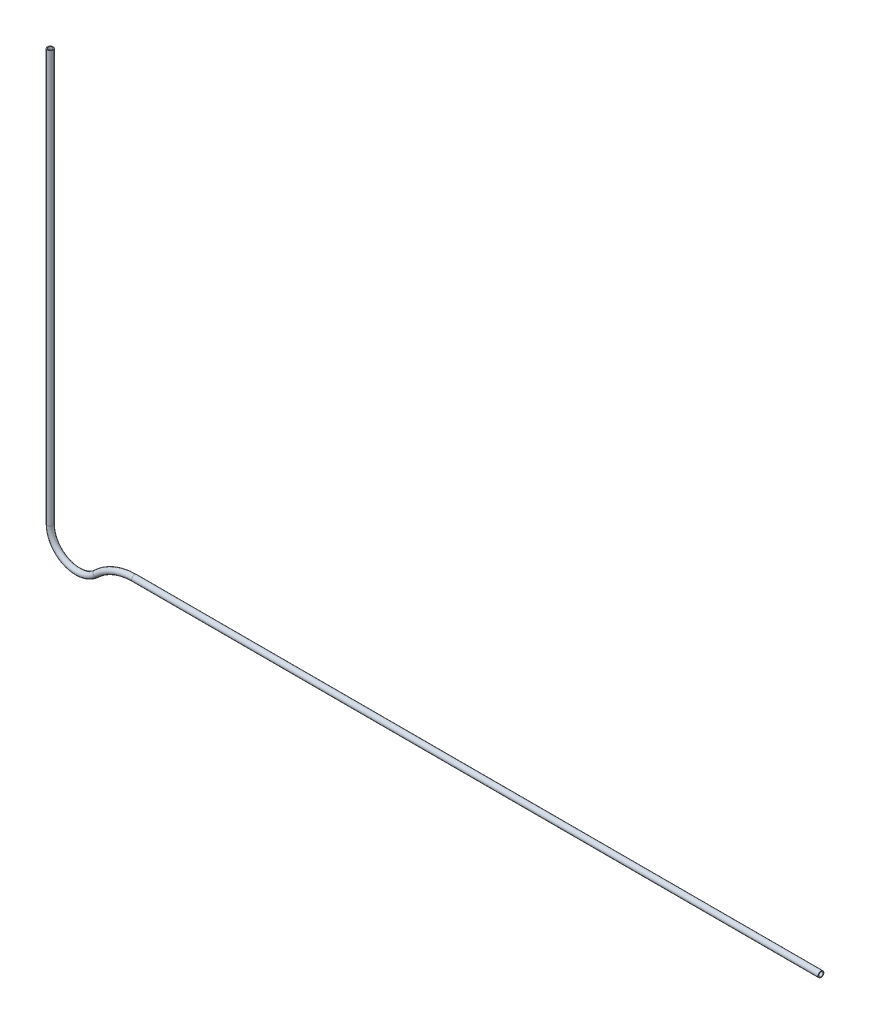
from build123d import *

# Parameters (mm, degrees)
SKETCH_1_R   = 10.5
SKETCH_1_R_2 = 7.7


with BuildPart() as part:
    # Sweep 1: sweep along a path in Sketch 2
    with BuildLine(Plane.XY) as sweep_1_path:
        Line((0, 0), (-2500, 0))
        ThreePointArc((-2500, 0), (-2574.317979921, -14.320604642), (-2637.993175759, -55.231621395))
        ThreePointArc((-2637.993175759, -55.231621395), (-2746.361969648, -74.770385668), (-2806.989763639, 17.152567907))
        Line((-2806.989763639, 17.152567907), (-2806.989763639, 1517.152567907))
    # Sketch 1 → Sweep 1 (sweep)
    with BuildSketch(Plane(origin=(0, 0, 0), x_dir=(0, 0, -1), z_dir=(1, 0, 0))):
        Circle(SKETCH_1_R)
        Circle(SKETCH_1_R_2, mode=Mode.SUBTRACT)
    sweep(path=sweep_1_path.line)


solid = part.part
